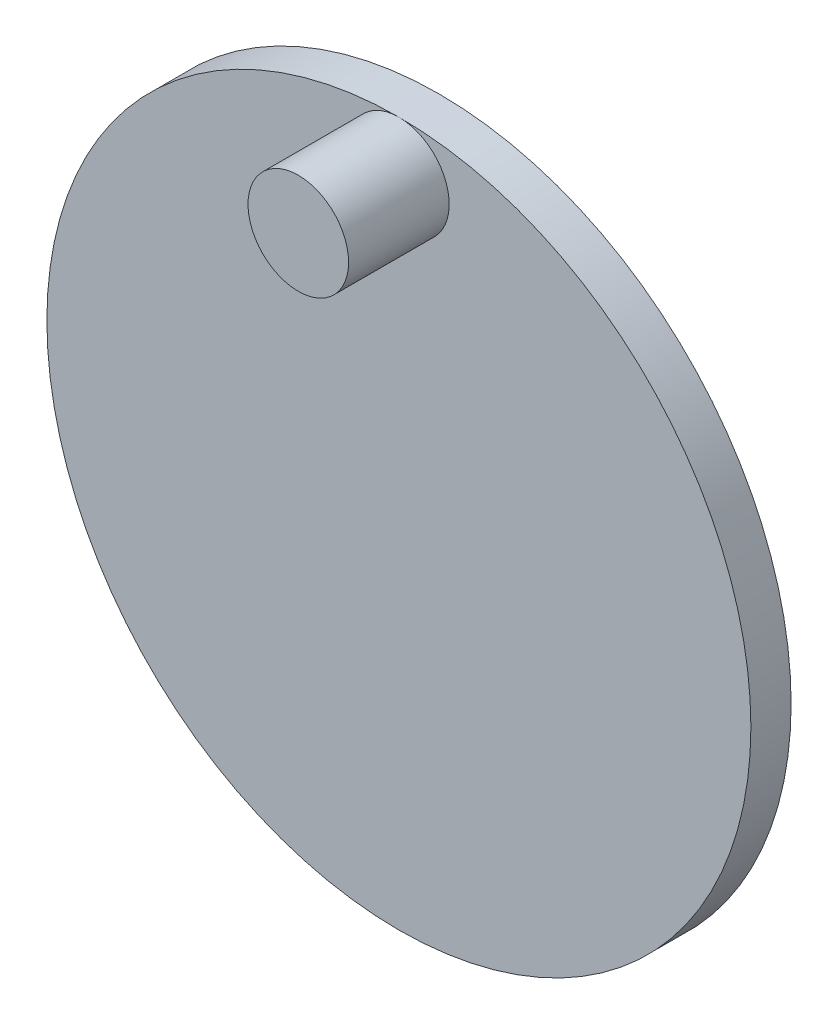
from build123d import *

# Parameters (mm, degrees)
SKETCH1_R           = 17.5
BOSS_EXTRUDE1_DEPTH = 2
SKETCH2_R           = 3.7
SKETCH2_R_2         = 2.7
BOSS_EXTRUDE3_DEPTH = 8
SKETCH4_R           = 2.5
BOSS_EXTRUDE4_DEPTH = 5


with BuildPart() as part:
    # Sketch1 → Boss-Extrude1 (new body)
    with BuildSketch(Plane.XY):
        Circle(SKETCH1_R)
    extrude(amount=BOSS_EXTRUDE1_DEPTH)

    # Sketch2 → Boss-Extrude3 (add)
    # profile 1 of 3: a face of its own
    with BuildSketch(Plane(origin=(0, 0, 0), x_dir=(-1, 0, 0), z_dir=(0, 0, -1))):
        with Locations(Location((0, 0, 0), (0, 0, 180))):
            Circle(SKETCH2_R)
        Circle(SKETCH2_R_2, mode=Mode.SUBTRACT)
    # profile 2 of 3: a face of its own
    with BuildSketch(Plane(origin=(0, 0, 0), x_dir=(-1, 0, 0), z_dir=(0, 0, -1))):
        with BuildLine():
            ThreePointArc((1.85, 1.966596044), (0, 2.7), (-1.85, 1.966596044))
            Line((-1.85, 1.966596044), (1.85, 1.966596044))
        make_face()
    # profile 3 of 3: a face of its own
    with BuildSketch(Plane(origin=(0, 0, 0), x_dir=(-1, 0, 0), z_dir=(0, 0, -1))):
        with BuildLine():
            Line((1.85, -1.966596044), (-1.85, -1.966596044))
            ThreePointArc((-1.85, -1.966596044), (0, -2.7), (1.85, -1.966596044))
        make_face()
    extrude(amount=BOSS_EXTRUDE3_DEPTH)

    # Sketch4 → Boss-Extrude4 (add)
    with BuildSketch(Plane.XY.offset(2)):
        with Locations(Location((0, 15, 0), (0, 0, 90))):
            Circle(SKETCH4_R)
    extrude(amount=BOSS_EXTRUDE4_DEPTH)


solid = part.part
